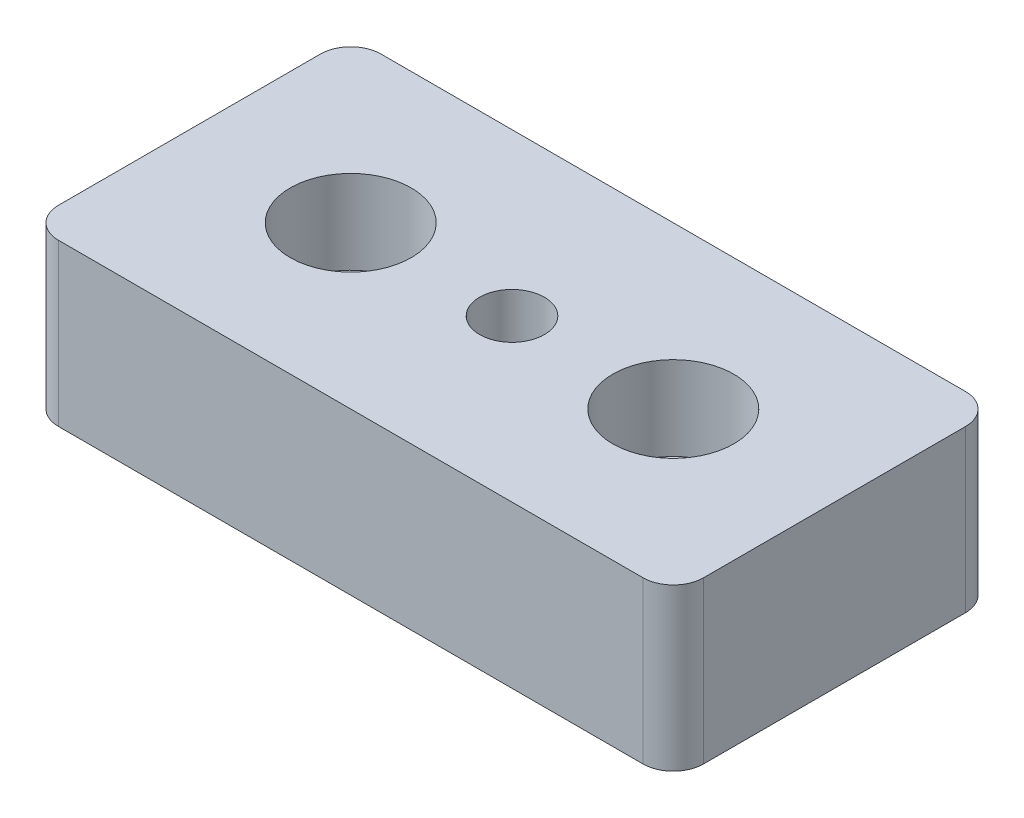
ISO-10303-21;
HEADER;
FILE_DESCRIPTION(('STEP AP214'),'2;1');
FILE_NAME('part.step','',(''),(''),'','','');
FILE_SCHEMA(('AUTOMOTIVE_DESIGN { 1 0 10303 214 1 1 1 1 }'));
ENDSEC;
DATA;
#1=APPLICATION_CONTEXT('core data for automotive mechanical design processes');
#2=APPLICATION_PROTOCOL_DEFINITION('international standard','automotive_design',2000,#1);
#3=PRODUCT_CONTEXT('',#1,'mechanical');
#4=PRODUCT('Part','Part','',(#3));
#5=PRODUCT_RELATED_PRODUCT_CATEGORY('part','',(#4));
#6=PRODUCT_DEFINITION_FORMATION('','',#4);
#7=PRODUCT_DEFINITION_CONTEXT('part definition',#1,'design');
#8=PRODUCT_DEFINITION('design','',#6,#7);
#9=PRODUCT_DEFINITION_SHAPE('','',#8);
#10=(LENGTH_UNIT() NAMED_UNIT(*) SI_UNIT(.MILLI.,.METRE.));
#11=(NAMED_UNIT(*) PLANE_ANGLE_UNIT() SI_UNIT($,.RADIAN.));
#12=(NAMED_UNIT(*) SI_UNIT($,.STERADIAN.) SOLID_ANGLE_UNIT());
#13=UNCERTAINTY_MEASURE_WITH_UNIT(LENGTH_MEASURE(1.E-05),#10,'distance_accuracy_value','');
#14=(GEOMETRIC_REPRESENTATION_CONTEXT(3) GLOBAL_UNCERTAINTY_ASSIGNED_CONTEXT((#13)) GLOBAL_UNIT_ASSIGNED_CONTEXT((#10,
#11,#12)) REPRESENTATION_CONTEXT('',''));
#15=CARTESIAN_POINT('',(0.,0.,0.));
#16=DIRECTION('',(0.,0.,1.));
#17=DIRECTION('',(1.,0.,0.));
#18=AXIS2_PLACEMENT_3D('',#15,#16,#17);
#19=CARTESIAN_POINT('',(38.1,-0.000999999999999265,12.7));
#20=DIRECTION('',(0.,1.,0.));
#21=DIRECTION('',(0.,0.,1.));
#22=AXIS2_PLACEMENT_3D('',#19,#20,#21);
#23=CYLINDRICAL_SURFACE('',#22,3.2639);
#24=CARTESIAN_POINT('',(38.1,0.,12.7));
#25=DIRECTION('',(0.,1.,0.));
#26=DIRECTION('',(0.,0.,1.));
#27=AXIS2_PLACEMENT_3D('',#24,#25,#26);
#28=CIRCLE('',#27,3.2639);
#29=CARTESIAN_POINT('',(38.1,0.,15.9639));
#30=VERTEX_POINT('',#29);
#31=EDGE_CURVE('E164',#30,#30,#28,.F.);
#32=ORIENTED_EDGE('',*,*,#31,.T.);
#33=EDGE_LOOP('',(#32));
#34=FACE_BOUND('',#33,.T.);
#35=CARTESIAN_POINT('',(38.1,6.096,12.7));
#36=DIRECTION('',(0.,1.,0.));
#37=DIRECTION('',(0.,0.,1.));
#38=AXIS2_PLACEMENT_3D('',#35,#36,#37);
#39=CIRCLE('',#38,3.2639);
#40=CARTESIAN_POINT('',(38.1,6.096,15.9639));
#41=VERTEX_POINT('',#40);
#42=EDGE_CURVE('E244',#41,#41,#39,.T.);
#43=ORIENTED_EDGE('',*,*,#42,.T.);
#44=EDGE_LOOP('',(#43));
#45=FACE_BOUND('',#44,.T.);
#46=ADVANCED_FACE('F32',(#34,#45),#23,.F.);
#47=CARTESIAN_POINT('',(12.7,-0.000999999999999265,12.7));
#48=DIRECTION('',(0.,1.,0.));
#49=DIRECTION('',(0.,0.,1.));
#50=AXIS2_PLACEMENT_3D('',#47,#48,#49);
#51=CYLINDRICAL_SURFACE('',#50,3.2639);
#52=CARTESIAN_POINT('',(12.7,0.,12.7));
#53=DIRECTION('',(0.,1.,0.));
#54=DIRECTION('',(0.,0.,1.));
#55=AXIS2_PLACEMENT_3D('',#52,#53,#54);
#56=CIRCLE('',#55,3.2639);
#57=CARTESIAN_POINT('',(12.7,0.,15.9639));
#58=VERTEX_POINT('',#57);
#59=EDGE_CURVE('E225',#58,#58,#56,.F.);
#60=ORIENTED_EDGE('',*,*,#59,.T.);
#61=EDGE_LOOP('',(#60));
#62=FACE_BOUND('',#61,.T.);
#63=CARTESIAN_POINT('',(12.7,6.096,12.7));
#64=DIRECTION('',(0.,1.,0.));
#65=DIRECTION('',(0.,0.,1.));
#66=AXIS2_PLACEMENT_3D('',#63,#64,#65);
#67=CIRCLE('',#66,3.2639);
#68=CARTESIAN_POINT('',(12.7,6.096,15.9639));
#69=VERTEX_POINT('',#68);
#70=EDGE_CURVE('E235',#69,#69,#67,.T.);
#71=ORIENTED_EDGE('',*,*,#70,.T.);
#72=EDGE_LOOP('',(#71));
#73=FACE_BOUND('',#72,.T.);
#74=ADVANCED_FACE('F190',(#62,#73),#51,.F.);
#75=CARTESIAN_POINT('',(0.,0.,25.4));
#76=DIRECTION('',(1.,0.,0.));
#77=DIRECTION('',(0.,1.,0.));
#78=AXIS2_PLACEMENT_3D('',#75,#76,#77);
#79=PLANE('',#78);
#80=DIRECTION('',(0.,0.,-1.));
#81=VECTOR('',#80,1.);
#82=CARTESIAN_POINT('',(0.,0.,25.4));
#83=LINE('',#82,#81);
#84=CARTESIAN_POINT('',(0.,0.,23.0124));
#85=VERTEX_POINT('',#84);
#86=CARTESIAN_POINT('',(0.,0.,2.3876));
#87=VERTEX_POINT('',#86);
#88=EDGE_CURVE('E125',#85,#87,#83,.T.);
#89=ORIENTED_EDGE('',*,*,#88,.F.);
#90=DIRECTION('',(0.,-1.,0.));
#91=VECTOR('',#90,1.);
#92=CARTESIAN_POINT('',(0.,0.,23.0124));
#93=LINE('',#92,#91);
#94=CARTESIAN_POINT('',(0.,12.7,23.0124));
#95=VERTEX_POINT('',#94);
#96=EDGE_CURVE('E11',#85,#95,#93,.F.);
#97=ORIENTED_EDGE('',*,*,#96,.T.);
#98=DIRECTION('',(0.,0.,-1.));
#99=VECTOR('',#98,1.);
#100=CARTESIAN_POINT('',(0.,12.7,25.4));
#101=LINE('',#100,#99);
#102=CARTESIAN_POINT('',(0.,12.7,2.3876));
#103=VERTEX_POINT('',#102);
#104=EDGE_CURVE('E120',#95,#103,#101,.T.);
#105=ORIENTED_EDGE('',*,*,#104,.T.);
#106=DIRECTION('',(0.,-1.,0.));
#107=VECTOR('',#106,1.);
#108=CARTESIAN_POINT('',(0.,0.,2.3876));
#109=LINE('',#108,#107);
#110=EDGE_CURVE('E40',#103,#87,#109,.T.);
#111=ORIENTED_EDGE('',*,*,#110,.T.);
#112=EDGE_LOOP('',(#89,#97,#105,#111));
#113=FACE_BOUND('',#112,.T.);
#114=ADVANCED_FACE('F34',(#113),#79,.F.);
#115=CARTESIAN_POINT('',(0.,0.,25.4));
#116=DIRECTION('',(0.,1.,0.));
#117=DIRECTION('',(0.,0.,1.));
#118=AXIS2_PLACEMENT_3D('',#115,#116,#117);
#119=PLANE('',#118);
#120=CARTESIAN_POINT('',(25.4,0.,12.7));
#121=DIRECTION('',(0.,1.,0.));
#122=DIRECTION('',(0.,0.,1.));
#123=AXIS2_PLACEMENT_3D('',#120,#121,#122);
#124=CIRCLE('',#123,2.5527);
#125=CARTESIAN_POINT('',(25.4,0.,15.2527));
#126=VERTEX_POINT('',#125);
#127=EDGE_CURVE('E221',#126,#126,#124,.T.);
#128=ORIENTED_EDGE('',*,*,#127,.T.);
#129=EDGE_LOOP('',(#128));
#130=FACE_BOUND('',#129,.T.);
#131=ORIENTED_EDGE('',*,*,#59,.F.);
#132=EDGE_LOOP('',(#131));
#133=FACE_BOUND('',#132,.T.);
#134=ORIENTED_EDGE('',*,*,#31,.F.);
#135=EDGE_LOOP('',(#134));
#136=FACE_BOUND('',#135,.T.);
#137=DIRECTION('',(1.,0.,0.));
#138=VECTOR('',#137,1.);
#139=CARTESIAN_POINT('',(0.,0.,0.));
#140=LINE('',#139,#138);
#141=CARTESIAN_POINT('',(2.3876,0.,0.));
#142=VERTEX_POINT('',#141);
#143=CARTESIAN_POINT('',(48.4124,0.,0.));
#144=VERTEX_POINT('',#143);
#145=EDGE_CURVE('E156',#142,#144,#140,.T.);
#146=ORIENTED_EDGE('',*,*,#145,.T.);
#147=CARTESIAN_POINT('',(48.4124,0.,2.3876));
#148=DIRECTION('',(0.,1.,0.));
#149=DIRECTION('',(0.,0.,1.));
#150=AXIS2_PLACEMENT_3D('',#147,#148,#149);
#151=CIRCLE('',#150,2.3876);
#152=CARTESIAN_POINT('',(50.8,0.,2.3876));
#153=VERTEX_POINT('',#152);
#154=EDGE_CURVE('E142',#144,#153,#151,.F.);
#155=ORIENTED_EDGE('',*,*,#154,.T.);
#156=DIRECTION('',(0.,0.,-1.));
#157=VECTOR('',#156,1.);
#158=CARTESIAN_POINT('',(50.8,0.,25.4));
#159=LINE('',#158,#157);
#160=CARTESIAN_POINT('',(50.8,0.,23.0124));
#161=VERTEX_POINT('',#160);
#162=EDGE_CURVE('E119',#161,#153,#159,.T.);
#163=ORIENTED_EDGE('',*,*,#162,.F.);
#164=CARTESIAN_POINT('',(48.4124,0.,23.0124));
#165=DIRECTION('',(0.,1.,0.));
#166=DIRECTION('',(0.,0.,1.));
#167=AXIS2_PLACEMENT_3D('',#164,#165,#166);
#168=CIRCLE('',#167,2.3876);
#169=CARTESIAN_POINT('',(48.4124,0.,25.4));
#170=VERTEX_POINT('',#169);
#171=EDGE_CURVE('E124',#161,#170,#168,.F.);
#172=ORIENTED_EDGE('',*,*,#171,.T.);
#173=DIRECTION('',(1.,0.,0.));
#174=VECTOR('',#173,1.);
#175=CARTESIAN_POINT('',(0.,0.,25.4));
#176=LINE('',#175,#174);
#177=CARTESIAN_POINT('',(2.3876,0.,25.4));
#178=VERTEX_POINT('',#177);
#179=EDGE_CURVE('E168',#178,#170,#176,.T.);
#180=ORIENTED_EDGE('',*,*,#179,.F.);
#181=CARTESIAN_POINT('',(2.3876,0.,23.0124));
#182=DIRECTION('',(0.,1.,0.));
#183=DIRECTION('',(0.,0.,1.));
#184=AXIS2_PLACEMENT_3D('',#181,#182,#183);
#185=CIRCLE('',#184,2.3876);
#186=EDGE_CURVE('E55',#178,#85,#185,.F.);
#187=ORIENTED_EDGE('',*,*,#186,.T.);
#188=ORIENTED_EDGE('',*,*,#88,.T.);
#189=CARTESIAN_POINT('',(2.3876,0.,2.3876));
#190=DIRECTION('',(0.,1.,0.));
#191=DIRECTION('',(0.,0.,1.));
#192=AXIS2_PLACEMENT_3D('',#189,#190,#191);
#193=CIRCLE('',#192,2.3876);
#194=EDGE_CURVE('E47',#87,#142,#193,.F.);
#195=ORIENTED_EDGE('',*,*,#194,.T.);
#196=EDGE_LOOP('',(#146,#155,#163,#172,#180,#187,#188,#195));
#197=FACE_BOUND('',#196,.T.);
#198=ADVANCED_FACE('F154',(#130,#133,#136,#197),#119,.F.);
#199=CARTESIAN_POINT('',(50.8,0.,25.4));
#200=DIRECTION('',(-1.,0.,0.));
#201=DIRECTION('',(0.,-1.,0.));
#202=AXIS2_PLACEMENT_3D('',#199,#200,#201);
#203=PLANE('',#202);
#204=ORIENTED_EDGE('',*,*,#162,.T.);
#205=DIRECTION('',(0.,1.,0.));
#206=VECTOR('',#205,1.);
#207=CARTESIAN_POINT('',(50.8,12.7,2.3876));
#208=LINE('',#207,#206);
#209=CARTESIAN_POINT('',(50.8,12.7,2.3876));
#210=VERTEX_POINT('',#209);
#211=EDGE_CURVE('E118',#153,#210,#208,.T.);
#212=ORIENTED_EDGE('',*,*,#211,.T.);
#213=DIRECTION('',(0.,0.,-1.));
#214=VECTOR('',#213,1.);
#215=CARTESIAN_POINT('',(50.8,12.7,25.4));
#216=LINE('',#215,#214);
#217=CARTESIAN_POINT('',(50.8,12.7,23.0124));
#218=VERTEX_POINT('',#217);
#219=EDGE_CURVE('E101',#218,#210,#216,.T.);
#220=ORIENTED_EDGE('',*,*,#219,.F.);
#221=DIRECTION('',(0.,1.,0.));
#222=VECTOR('',#221,1.);
#223=CARTESIAN_POINT('',(50.8,0.,23.0124));
#224=LINE('',#223,#222);
#225=EDGE_CURVE('E115',#218,#161,#224,.F.);
#226=ORIENTED_EDGE('',*,*,#225,.T.);
#227=EDGE_LOOP('',(#204,#212,#220,#226));
#228=FACE_BOUND('',#227,.T.);
#229=ADVANCED_FACE('F114',(#228),#203,.F.);
#230=CARTESIAN_POINT('',(0.,12.7,25.4));
#231=DIRECTION('',(0.,-1.,0.));
#232=DIRECTION('',(0.,0.,-1.));
#233=AXIS2_PLACEMENT_3D('',#230,#231,#232);
#234=PLANE('',#233);
#235=CARTESIAN_POINT('',(25.4,12.7,12.7));
#236=DIRECTION('',(0.,1.,0.));
#237=DIRECTION('',(0.,0.,1.));
#238=AXIS2_PLACEMENT_3D('',#235,#236,#237);
#239=CIRCLE('',#238,2.55269999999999);
#240=CARTESIAN_POINT('',(25.4,12.7,15.2527));
#241=VERTEX_POINT('',#240);
#242=EDGE_CURVE('E247',#241,#241,#239,.T.);
#243=ORIENTED_EDGE('',*,*,#242,.F.);
#244=EDGE_LOOP('',(#243));
#245=FACE_BOUND('',#244,.T.);
#246=CARTESIAN_POINT('',(38.1,12.7,12.7));
#247=DIRECTION('',(0.,1.,0.));
#248=DIRECTION('',(0.,0.,1.));
#249=AXIS2_PLACEMENT_3D('',#246,#247,#248);
#250=CIRCLE('',#249,4.7625);
#251=CARTESIAN_POINT('',(38.1,12.7,17.4625));
#252=VERTEX_POINT('',#251);
#253=EDGE_CURVE('E241',#252,#252,#250,.T.);
#254=ORIENTED_EDGE('',*,*,#253,.F.);
#255=EDGE_LOOP('',(#254));
#256=FACE_BOUND('',#255,.T.);
#257=CARTESIAN_POINT('',(12.7,12.7,12.7));
#258=DIRECTION('',(0.,1.,0.));
#259=DIRECTION('',(0.,0.,1.));
#260=AXIS2_PLACEMENT_3D('',#257,#258,#259);
#261=CIRCLE('',#260,4.7625);
#262=CARTESIAN_POINT('',(12.7,12.7,17.4625));
#263=VERTEX_POINT('',#262);
#264=EDGE_CURVE('E232',#263,#263,#261,.T.);
#265=ORIENTED_EDGE('',*,*,#264,.F.);
#266=EDGE_LOOP('',(#265));
#267=FACE_BOUND('',#266,.T.);
#268=ORIENTED_EDGE('',*,*,#219,.T.);
#269=CARTESIAN_POINT('',(48.4124,12.7,2.3876));
#270=DIRECTION('',(0.,-1.,0.));
#271=DIRECTION('',(0.,0.,-1.));
#272=AXIS2_PLACEMENT_3D('',#269,#270,#271);
#273=CIRCLE('',#272,2.3876);
#274=CARTESIAN_POINT('',(48.4124,12.7,0.));
#275=VERTEX_POINT('',#274);
#276=EDGE_CURVE('E108',#210,#275,#273,.F.);
#277=ORIENTED_EDGE('',*,*,#276,.T.);
#278=DIRECTION('',(-1.,0.,0.));
#279=VECTOR('',#278,1.);
#280=CARTESIAN_POINT('',(0.,12.7,0.));
#281=LINE('',#280,#279);
#282=CARTESIAN_POINT('',(2.3876,12.7,0.));
#283=VERTEX_POINT('',#282);
#284=EDGE_CURVE('E163',#275,#283,#281,.T.);
#285=ORIENTED_EDGE('',*,*,#284,.T.);
#286=CARTESIAN_POINT('',(2.3876,12.7,2.3876));
#287=DIRECTION('',(0.,-1.,0.));
#288=DIRECTION('',(0.,0.,-1.));
#289=AXIS2_PLACEMENT_3D('',#286,#287,#288);
#290=CIRCLE('',#289,2.3876);
#291=EDGE_CURVE('E127',#283,#103,#290,.F.);
#292=ORIENTED_EDGE('',*,*,#291,.T.);
#293=ORIENTED_EDGE('',*,*,#104,.F.);
#294=CARTESIAN_POINT('',(2.3876,12.7,23.0124));
#295=DIRECTION('',(0.,-1.,0.));
#296=DIRECTION('',(0.,0.,-1.));
#297=AXIS2_PLACEMENT_3D('',#294,#295,#296);
#298=CIRCLE('',#297,2.3876);
#299=CARTESIAN_POINT('',(2.3876,12.7,25.4));
#300=VERTEX_POINT('',#299);
#301=EDGE_CURVE('E109',#95,#300,#298,.F.);
#302=ORIENTED_EDGE('',*,*,#301,.T.);
#303=DIRECTION('',(-1.,0.,0.));
#304=VECTOR('',#303,1.);
#305=CARTESIAN_POINT('',(0.,12.7,25.4));
#306=LINE('',#305,#304);
#307=CARTESIAN_POINT('',(48.4124,12.7,25.4));
#308=VERTEX_POINT('',#307);
#309=EDGE_CURVE('E103',#308,#300,#306,.T.);
#310=ORIENTED_EDGE('',*,*,#309,.F.);
#311=CARTESIAN_POINT('',(48.4124,12.7,23.0124));
#312=DIRECTION('',(0.,-1.,0.));
#313=DIRECTION('',(0.,0.,-1.));
#314=AXIS2_PLACEMENT_3D('',#311,#312,#313);
#315=CIRCLE('',#314,2.3876);
#316=EDGE_CURVE('E98',#308,#218,#315,.F.);
#317=ORIENTED_EDGE('',*,*,#316,.T.);
#318=EDGE_LOOP('',(#268,#277,#285,#292,#293,#302,#310,#317));
#319=FACE_BOUND('',#318,.T.);
#320=ADVANCED_FACE('F100',(#245,#256,#267,#319),#234,.F.);
#321=CARTESIAN_POINT('',(0.,12.7,25.4));
#322=DIRECTION('',(0.,0.,-1.));
#323=DIRECTION('',(-1.,0.,0.));
#324=AXIS2_PLACEMENT_3D('',#321,#322,#323);
#325=PLANE('',#324);
#326=ORIENTED_EDGE('',*,*,#179,.T.);
#327=DIRECTION('',(0.,1.,0.));
#328=VECTOR('',#327,1.);
#329=CARTESIAN_POINT('',(48.4124,12.6999999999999,25.4));
#330=LINE('',#329,#328);
#331=EDGE_CURVE('E147',#170,#308,#330,.T.);
#332=ORIENTED_EDGE('',*,*,#331,.T.);
#333=ORIENTED_EDGE('',*,*,#309,.T.);
#334=DIRECTION('',(0.,-1.,0.));
#335=VECTOR('',#334,1.);
#336=CARTESIAN_POINT('',(2.3876,12.7,25.4));
#337=LINE('',#336,#335);
#338=EDGE_CURVE('E144',#300,#178,#337,.T.);
#339=ORIENTED_EDGE('',*,*,#338,.T.);
#340=EDGE_LOOP('',(#326,#332,#333,#339));
#341=FACE_BOUND('',#340,.T.);
#342=ADVANCED_FACE('F205',(#341),#325,.F.);
#343=CARTESIAN_POINT('',(0.,12.7,0.));
#344=DIRECTION('',(0.,0.,-1.));
#345=DIRECTION('',(-1.,0.,0.));
#346=AXIS2_PLACEMENT_3D('',#343,#344,#345);
#347=PLANE('',#346);
#348=ORIENTED_EDGE('',*,*,#284,.F.);
#349=DIRECTION('',(0.,1.,0.));
#350=VECTOR('',#349,1.);
#351=CARTESIAN_POINT('',(48.4124,0.,0.));
#352=LINE('',#351,#350);
#353=EDGE_CURVE('E137',#275,#144,#352,.F.);
#354=ORIENTED_EDGE('',*,*,#353,.T.);
#355=ORIENTED_EDGE('',*,*,#145,.F.);
#356=DIRECTION('',(0.,-1.,0.));
#357=VECTOR('',#356,1.);
#358=CARTESIAN_POINT('',(2.3876,12.7,0.));
#359=LINE('',#358,#357);
#360=EDGE_CURVE('E135',#142,#283,#359,.F.);
#361=ORIENTED_EDGE('',*,*,#360,.T.);
#362=EDGE_LOOP('',(#348,#354,#355,#361));
#363=FACE_BOUND('',#362,.T.);
#364=ADVANCED_FACE('F160',(#363),#347,.T.);
#365=CARTESIAN_POINT('',(12.7,6.096,12.7));
#366=DIRECTION('',(0.,1.,0.));
#367=DIRECTION('',(0.,0.,1.));
#368=AXIS2_PLACEMENT_3D('',#365,#366,#367);
#369=CYLINDRICAL_SURFACE('',#368,4.7625);
#370=CARTESIAN_POINT('',(12.7,6.096,12.7));
#371=DIRECTION('',(0.,1.,0.));
#372=DIRECTION('',(0.,0.,1.));
#373=AXIS2_PLACEMENT_3D('',#370,#371,#372);
#374=CIRCLE('',#373,4.7625);
#375=CARTESIAN_POINT('',(12.7,6.096,17.4625));
#376=VERTEX_POINT('',#375);
#377=EDGE_CURVE('E227',#376,#376,#374,.T.);
#378=CARTESIAN_POINT('',(12.7,6.096,17.4625));
#379=CARTESIAN_POINT('',(12.7,6.16479166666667,17.4625));
#380=CARTESIAN_POINT('',(12.7,6.23358333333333,17.4625));
#381=CARTESIAN_POINT('',(12.7,6.37116666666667,17.4625));
#382=CARTESIAN_POINT('',(12.7,6.43995833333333,17.4625));
#383=CARTESIAN_POINT('',(12.7,6.57754166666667,17.4625));
#384=CARTESIAN_POINT('',(12.7,6.64633333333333,17.4625));
#385=CARTESIAN_POINT('',(12.7,6.78391666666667,17.4625));
#386=CARTESIAN_POINT('',(12.7,6.85270833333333,17.4625));
#387=CARTESIAN_POINT('',(12.7,6.99029166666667,17.4625));
#388=CARTESIAN_POINT('',(12.7,7.05908333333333,17.4625));
#389=CARTESIAN_POINT('',(12.7,7.19666666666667,17.4625));
#390=CARTESIAN_POINT('',(12.7,7.26545833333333,17.4625));
#391=CARTESIAN_POINT('',(12.7,7.40304166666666,17.4625));
#392=CARTESIAN_POINT('',(12.7,7.47183333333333,17.4625));
#393=CARTESIAN_POINT('',(12.7,7.60941666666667,17.4625));
#394=CARTESIAN_POINT('',(12.7,7.67820833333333,17.4625));
#395=CARTESIAN_POINT('',(12.7,7.81579166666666,17.4625));
#396=CARTESIAN_POINT('',(12.7,7.88458333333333,17.4625));
#397=CARTESIAN_POINT('',(12.7,8.02216666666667,17.4625));
#398=CARTESIAN_POINT('',(12.7,8.09095833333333,17.4625));
#399=CARTESIAN_POINT('',(12.7,8.22854166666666,17.4625));
#400=CARTESIAN_POINT('',(12.7,8.29733333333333,17.4625));
#401=CARTESIAN_POINT('',(12.7,8.43491666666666,17.4625));
#402=CARTESIAN_POINT('',(12.7,8.50370833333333,17.4625));
#403=CARTESIAN_POINT('',(12.7,8.64129166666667,17.4625));
#404=CARTESIAN_POINT('',(12.7,8.71008333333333,17.4625));
#405=CARTESIAN_POINT('',(12.7,8.84766666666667,17.4625));
#406=CARTESIAN_POINT('',(12.7,8.91645833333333,17.4625));
#407=CARTESIAN_POINT('',(12.7,9.05404166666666,17.4625));
#408=CARTESIAN_POINT('',(12.7,9.12283333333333,17.4625));
#409=CARTESIAN_POINT('',(12.7,9.26041666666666,17.4625));
#410=CARTESIAN_POINT('',(12.7,9.32920833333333,17.4625));
#411=CARTESIAN_POINT('',(12.7,9.46679166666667,17.4625));
#412=CARTESIAN_POINT('',(12.7,9.53558333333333,17.4625));
#413=CARTESIAN_POINT('',(12.7,9.67316666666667,17.4625));
#414=CARTESIAN_POINT('',(12.7,9.74195833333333,17.4625));
#415=CARTESIAN_POINT('',(12.7,9.87954166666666,17.4625));
#416=CARTESIAN_POINT('',(12.7,9.94833333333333,17.4625));
#417=CARTESIAN_POINT('',(12.7,10.0859166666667,17.4625));
#418=CARTESIAN_POINT('',(12.7,10.1547083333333,17.4625));
#419=CARTESIAN_POINT('',(12.7,10.2922916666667,17.4625));
#420=CARTESIAN_POINT('',(12.7,10.3610833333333,17.4625));
#421=CARTESIAN_POINT('',(12.7,10.4986666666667,17.4625));
#422=CARTESIAN_POINT('',(12.7,10.5674583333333,17.4625));
#423=CARTESIAN_POINT('',(12.7,10.7050416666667,17.4625));
#424=CARTESIAN_POINT('',(12.7,10.7738333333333,17.4625));
#425=CARTESIAN_POINT('',(12.7,10.9114166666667,17.4625));
#426=CARTESIAN_POINT('',(12.7,10.9802083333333,17.4625));
#427=CARTESIAN_POINT('',(12.7,11.1177916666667,17.4625));
#428=CARTESIAN_POINT('',(12.7,11.1865833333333,17.4625));
#429=CARTESIAN_POINT('',(12.7,11.3241666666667,17.4625));
#430=CARTESIAN_POINT('',(12.7,11.3929583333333,17.4625));
#431=CARTESIAN_POINT('',(12.7,11.5305416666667,17.4625));
#432=CARTESIAN_POINT('',(12.7,11.5993333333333,17.4625));
#433=CARTESIAN_POINT('',(12.7,11.7369166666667,17.4625));
#434=CARTESIAN_POINT('',(12.7,11.8057083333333,17.4625));
#435=CARTESIAN_POINT('',(12.7,11.9432916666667,17.4625));
#436=CARTESIAN_POINT('',(12.7,12.0120833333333,17.4625));
#437=CARTESIAN_POINT('',(12.7,12.1496666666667,17.4625));
#438=CARTESIAN_POINT('',(12.7,12.2184583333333,17.4625));
#439=CARTESIAN_POINT('',(12.7,12.3560416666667,17.4625));
#440=CARTESIAN_POINT('',(12.7,12.4248333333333,17.4625));
#441=CARTESIAN_POINT('',(12.7,12.5624166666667,17.4625));
#442=CARTESIAN_POINT('',(12.7,12.6312083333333,17.4625));
#443=CARTESIAN_POINT('',(12.7,12.7,17.4625));
#444=B_SPLINE_CURVE_WITH_KNOTS('',3,(#378,#379,#380,#381,#382,#383,#384,#385,#386,#387,#388,
#389,#390,#391,#392,#393,#394,#395,#396,#397,#398,#399,#400,#401,#402,#403,#404,#405,#406,#407,
#408,#409,#410,#411,#412,#413,#414,#415,#416,#417,#418,#419,#420,#421,#422,#423,#424,#425,#426,
#427,#428,#429,#430,#431,#432,#433,#434,#435,#436,#437,#438,#439,#440,#441,#442,#443),
.UNSPECIFIED.,.F.,.F.,(4,2,2,2,2,2,2,2,2,2,2,2,2,2,2,2,2,2,2,2,2,2,2,2,2,2,2,2,2,2,2,2,4),(0.,
0.206375,0.41275,0.619125,0.8255,1.031875,1.23825,1.444625,1.651,1.857375,2.06375,2.270125,
2.4765,2.682875,2.88925,3.095625,3.302,3.508375,3.71475,3.921125,4.1275,4.333875,4.54025,
4.746625,4.953,5.159375,5.36575,5.572125,5.7785,5.984875,6.19125,6.397625,6.604),.UNSPECIFIED.);
#445=EDGE_CURVE('BSEAM204',#376,#263,#444,.T.);
#446=ORIENTED_EDGE('',*,*,#377,.F.);
#447=ORIENTED_EDGE('',*,*,#264,.T.);
#448=ORIENTED_EDGE('',*,*,#445,.T.);
#449=ORIENTED_EDGE('',*,*,#445,.F.);
#450=EDGE_LOOP('',(#446,#448,#447,#449));
#451=FACE_BOUND('',#450,.T.);
#452=ADVANCED_FACE('F204',(#451),#369,.F.);
#453=CARTESIAN_POINT('',(12.7,6.096,12.7));
#454=DIRECTION('',(0.,1.,0.));
#455=DIRECTION('',(0.,0.,1.));
#456=AXIS2_PLACEMENT_3D('',#453,#454,#455);
#457=PLANE('',#456);
#458=ORIENTED_EDGE('',*,*,#70,.F.);
#459=EDGE_LOOP('',(#458));
#460=FACE_BOUND('',#459,.T.);
#461=ORIENTED_EDGE('',*,*,#377,.T.);
#462=EDGE_LOOP('',(#461));
#463=FACE_BOUND('',#462,.T.);
#464=ADVANCED_FACE('F258',(#460,#463),#457,.T.);
#465=CARTESIAN_POINT('',(38.1,6.096,12.7));
#466=DIRECTION('',(0.,1.,0.));
#467=DIRECTION('',(0.,0.,1.));
#468=AXIS2_PLACEMENT_3D('',#465,#466,#467);
#469=CYLINDRICAL_SURFACE('',#468,4.7625);
#470=CARTESIAN_POINT('',(38.1,6.096,12.7));
#471=DIRECTION('',(0.,1.,0.));
#472=DIRECTION('',(0.,0.,1.));
#473=AXIS2_PLACEMENT_3D('',#470,#471,#472);
#474=CIRCLE('',#473,4.7625);
#475=CARTESIAN_POINT('',(38.1,6.096,17.4625));
#476=VERTEX_POINT('',#475);
#477=EDGE_CURVE('E238',#476,#476,#474,.T.);
#478=CARTESIAN_POINT('',(38.1,6.096,17.4625));
#479=CARTESIAN_POINT('',(38.1,6.16479166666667,17.4625));
#480=CARTESIAN_POINT('',(38.1,6.23358333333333,17.4625));
#481=CARTESIAN_POINT('',(38.1,6.37116666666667,17.4625));
#482=CARTESIAN_POINT('',(38.1,6.43995833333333,17.4625));
#483=CARTESIAN_POINT('',(38.1,6.57754166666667,17.4625));
#484=CARTESIAN_POINT('',(38.1,6.64633333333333,17.4625));
#485=CARTESIAN_POINT('',(38.1,6.78391666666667,17.4625));
#486=CARTESIAN_POINT('',(38.1,6.85270833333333,17.4625));
#487=CARTESIAN_POINT('',(38.1,6.99029166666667,17.4625));
#488=CARTESIAN_POINT('',(38.1,7.05908333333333,17.4625));
#489=CARTESIAN_POINT('',(38.1,7.19666666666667,17.4625));
#490=CARTESIAN_POINT('',(38.1,7.26545833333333,17.4625));
#491=CARTESIAN_POINT('',(38.1,7.40304166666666,17.4625));
#492=CARTESIAN_POINT('',(38.1,7.47183333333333,17.4625));
#493=CARTESIAN_POINT('',(38.1,7.60941666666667,17.4625));
#494=CARTESIAN_POINT('',(38.1,7.67820833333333,17.4625));
#495=CARTESIAN_POINT('',(38.1,7.81579166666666,17.4625));
#496=CARTESIAN_POINT('',(38.1,7.88458333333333,17.4625));
#497=CARTESIAN_POINT('',(38.1,8.02216666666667,17.4625));
#498=CARTESIAN_POINT('',(38.1,8.09095833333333,17.4625));
#499=CARTESIAN_POINT('',(38.1,8.22854166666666,17.4625));
#500=CARTESIAN_POINT('',(38.1,8.29733333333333,17.4625));
#501=CARTESIAN_POINT('',(38.1,8.43491666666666,17.4625));
#502=CARTESIAN_POINT('',(38.1,8.50370833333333,17.4625));
#503=CARTESIAN_POINT('',(38.1,8.64129166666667,17.4625));
#504=CARTESIAN_POINT('',(38.1,8.71008333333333,17.4625));
#505=CARTESIAN_POINT('',(38.1,8.84766666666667,17.4625));
#506=CARTESIAN_POINT('',(38.1,8.91645833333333,17.4625));
#507=CARTESIAN_POINT('',(38.1,9.05404166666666,17.4625));
#508=CARTESIAN_POINT('',(38.1,9.12283333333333,17.4625));
#509=CARTESIAN_POINT('',(38.1,9.26041666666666,17.4625));
#510=CARTESIAN_POINT('',(38.1,9.32920833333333,17.4625));
#511=CARTESIAN_POINT('',(38.1,9.46679166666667,17.4625));
#512=CARTESIAN_POINT('',(38.1,9.53558333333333,17.4625));
#513=CARTESIAN_POINT('',(38.1,9.67316666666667,17.4625));
#514=CARTESIAN_POINT('',(38.1,9.74195833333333,17.4625));
#515=CARTESIAN_POINT('',(38.1,9.87954166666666,17.4625));
#516=CARTESIAN_POINT('',(38.1,9.94833333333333,17.4625));
#517=CARTESIAN_POINT('',(38.1,10.0859166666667,17.4625));
#518=CARTESIAN_POINT('',(38.1,10.1547083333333,17.4625));
#519=CARTESIAN_POINT('',(38.1,10.2922916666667,17.4625));
#520=CARTESIAN_POINT('',(38.1,10.3610833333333,17.4625));
#521=CARTESIAN_POINT('',(38.1,10.4986666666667,17.4625));
#522=CARTESIAN_POINT('',(38.1,10.5674583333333,17.4625));
#523=CARTESIAN_POINT('',(38.1,10.7050416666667,17.4625));
#524=CARTESIAN_POINT('',(38.1,10.7738333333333,17.4625));
#525=CARTESIAN_POINT('',(38.1,10.9114166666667,17.4625));
#526=CARTESIAN_POINT('',(38.1,10.9802083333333,17.4625));
#527=CARTESIAN_POINT('',(38.1,11.1177916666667,17.4625));
#528=CARTESIAN_POINT('',(38.1,11.1865833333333,17.4625));
#529=CARTESIAN_POINT('',(38.1,11.3241666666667,17.4625));
#530=CARTESIAN_POINT('',(38.1,11.3929583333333,17.4625));
#531=CARTESIAN_POINT('',(38.1,11.5305416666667,17.4625));
#532=CARTESIAN_POINT('',(38.1,11.5993333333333,17.4625));
#533=CARTESIAN_POINT('',(38.1,11.7369166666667,17.4625));
#534=CARTESIAN_POINT('',(38.1,11.8057083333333,17.4625));
#535=CARTESIAN_POINT('',(38.1,11.9432916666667,17.4625));
#536=CARTESIAN_POINT('',(38.1,12.0120833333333,17.4625));
#537=CARTESIAN_POINT('',(38.1,12.1496666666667,17.4625));
#538=CARTESIAN_POINT('',(38.1,12.2184583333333,17.4625));
#539=CARTESIAN_POINT('',(38.1,12.3560416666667,17.4625));
#540=CARTESIAN_POINT('',(38.1,12.4248333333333,17.4625));
#541=CARTESIAN_POINT('',(38.1,12.5624166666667,17.4625));
#542=CARTESIAN_POINT('',(38.1,12.6312083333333,17.4625));
#543=CARTESIAN_POINT('',(38.1,12.7,17.4625));
#544=B_SPLINE_CURVE_WITH_KNOTS('',3,(#478,#479,#480,#481,#482,#483,#484,#485,#486,#487,#488,
#489,#490,#491,#492,#493,#494,#495,#496,#497,#498,#499,#500,#501,#502,#503,#504,#505,#506,#507,
#508,#509,#510,#511,#512,#513,#514,#515,#516,#517,#518,#519,#520,#521,#522,#523,#524,#525,#526,
#527,#528,#529,#530,#531,#532,#533,#534,#535,#536,#537,#538,#539,#540,#541,#542,#543),
.UNSPECIFIED.,.F.,.F.,(4,2,2,2,2,2,2,2,2,2,2,2,2,2,2,2,2,2,2,2,2,2,2,2,2,2,2,2,2,2,2,2,4),(0.,
0.206375,0.41275,0.619125,0.8255,1.031875,1.23825,1.444625,1.651,1.857375,2.06375,2.270125,
2.4765,2.682875,2.88925,3.095625,3.302,3.508375,3.71475,3.921125,4.1275,4.333875,4.54025,
4.746625,4.953,5.159375,5.36575,5.572125,5.7785,5.984875,6.19125,6.397625,6.604),.UNSPECIFIED.);
#545=EDGE_CURVE('BSEAM263',#476,#252,#544,.T.);
#546=ORIENTED_EDGE('',*,*,#477,.F.);
#547=ORIENTED_EDGE('',*,*,#253,.T.);
#548=ORIENTED_EDGE('',*,*,#545,.T.);
#549=ORIENTED_EDGE('',*,*,#545,.F.);
#550=EDGE_LOOP('',(#546,#548,#547,#549));
#551=FACE_BOUND('',#550,.T.);
#552=ADVANCED_FACE('F263',(#551),#469,.F.);
#553=CARTESIAN_POINT('',(38.1,6.096,12.7));
#554=DIRECTION('',(0.,1.,0.));
#555=DIRECTION('',(0.,0.,1.));
#556=AXIS2_PLACEMENT_3D('',#553,#554,#555);
#557=PLANE('',#556);
#558=ORIENTED_EDGE('',*,*,#42,.F.);
#559=EDGE_LOOP('',(#558));
#560=FACE_BOUND('',#559,.T.);
#561=ORIENTED_EDGE('',*,*,#477,.T.);
#562=EDGE_LOOP('',(#561));
#563=FACE_BOUND('',#562,.T.);
#564=ADVANCED_FACE('F186',(#560,#563),#557,.T.);
#565=CARTESIAN_POINT('',(25.4,12.7,12.7));
#566=DIRECTION('',(0.,1.,0.));
#567=DIRECTION('',(0.,0.,1.));
#568=AXIS2_PLACEMENT_3D('',#565,#566,#567);
#569=CYLINDRICAL_SURFACE('',#568,2.55269999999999);
#570=ORIENTED_EDGE('',*,*,#127,.F.);
#571=EDGE_LOOP('',(#570));
#572=FACE_BOUND('',#571,.T.);
#573=ORIENTED_EDGE('',*,*,#242,.T.);
#574=EDGE_LOOP('',(#573));
#575=FACE_BOUND('',#574,.T.);
#576=ADVANCED_FACE('F178',(#572,#575),#569,.F.);
#577=CARTESIAN_POINT('',(48.4124,0.,2.3876));
#578=DIRECTION('',(0.,-1.,0.));
#579=DIRECTION('',(1.,0.,0.));
#580=AXIS2_PLACEMENT_3D('',#577,#578,#579);
#581=CYLINDRICAL_SURFACE('',#580,2.3876);
#582=ORIENTED_EDGE('',*,*,#154,.F.);
#583=ORIENTED_EDGE('',*,*,#353,.F.);
#584=ORIENTED_EDGE('',*,*,#276,.F.);
#585=ORIENTED_EDGE('',*,*,#211,.F.);
#586=EDGE_LOOP('',(#582,#583,#584,#585));
#587=FACE_BOUND('',#586,.T.);
#588=ADVANCED_FACE('F176',(#587),#581,.T.);
#589=CARTESIAN_POINT('',(48.4124,12.6999999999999,23.0124));
#590=DIRECTION('',(0.,1.,0.));
#591=DIRECTION('',(-1.,0.,0.));
#592=AXIS2_PLACEMENT_3D('',#589,#590,#591);
#593=CYLINDRICAL_SURFACE('',#592,2.3876);
#594=ORIENTED_EDGE('',*,*,#171,.F.);
#595=ORIENTED_EDGE('',*,*,#225,.F.);
#596=ORIENTED_EDGE('',*,*,#316,.F.);
#597=ORIENTED_EDGE('',*,*,#331,.F.);
#598=EDGE_LOOP('',(#594,#595,#596,#597));
#599=FACE_BOUND('',#598,.T.);
#600=ADVANCED_FACE('F123',(#599),#593,.T.);
#601=CARTESIAN_POINT('',(2.3876,12.7,23.0124));
#602=DIRECTION('',(0.,-1.,0.));
#603=DIRECTION('',(1.,0.,0.));
#604=AXIS2_PLACEMENT_3D('',#601,#602,#603);
#605=CYLINDRICAL_SURFACE('',#604,2.3876);
#606=ORIENTED_EDGE('',*,*,#301,.F.);
#607=ORIENTED_EDGE('',*,*,#96,.F.);
#608=ORIENTED_EDGE('',*,*,#186,.F.);
#609=ORIENTED_EDGE('',*,*,#338,.F.);
#610=EDGE_LOOP('',(#606,#607,#608,#609));
#611=FACE_BOUND('',#610,.T.);
#612=ADVANCED_FACE('F184',(#611),#605,.T.);
#613=CARTESIAN_POINT('',(2.3876,0.,2.3876));
#614=DIRECTION('',(0.,1.,0.));
#615=DIRECTION('',(-1.,0.,0.));
#616=AXIS2_PLACEMENT_3D('',#613,#614,#615);
#617=CYLINDRICAL_SURFACE('',#616,2.3876);
#618=ORIENTED_EDGE('',*,*,#291,.F.);
#619=ORIENTED_EDGE('',*,*,#360,.F.);
#620=ORIENTED_EDGE('',*,*,#194,.F.);
#621=ORIENTED_EDGE('',*,*,#110,.F.);
#622=EDGE_LOOP('',(#618,#619,#620,#621));
#623=FACE_BOUND('',#622,.T.);
#624=ADVANCED_FACE('F166',(#623),#617,.T.);
#625=CLOSED_SHELL('',(#46,#74,#114,#198,#229,#320,#342,#364,#452,#464,#552,#564,#576,#588,#600,
#612,#624));
#626=MANIFOLD_SOLID_BREP('B2',#625);
#627=ADVANCED_BREP_SHAPE_REPRESENTATION('',(#18,#626),#14);
#628=SHAPE_DEFINITION_REPRESENTATION(#9,#627);
ENDSEC;
END-ISO-10303-21;
